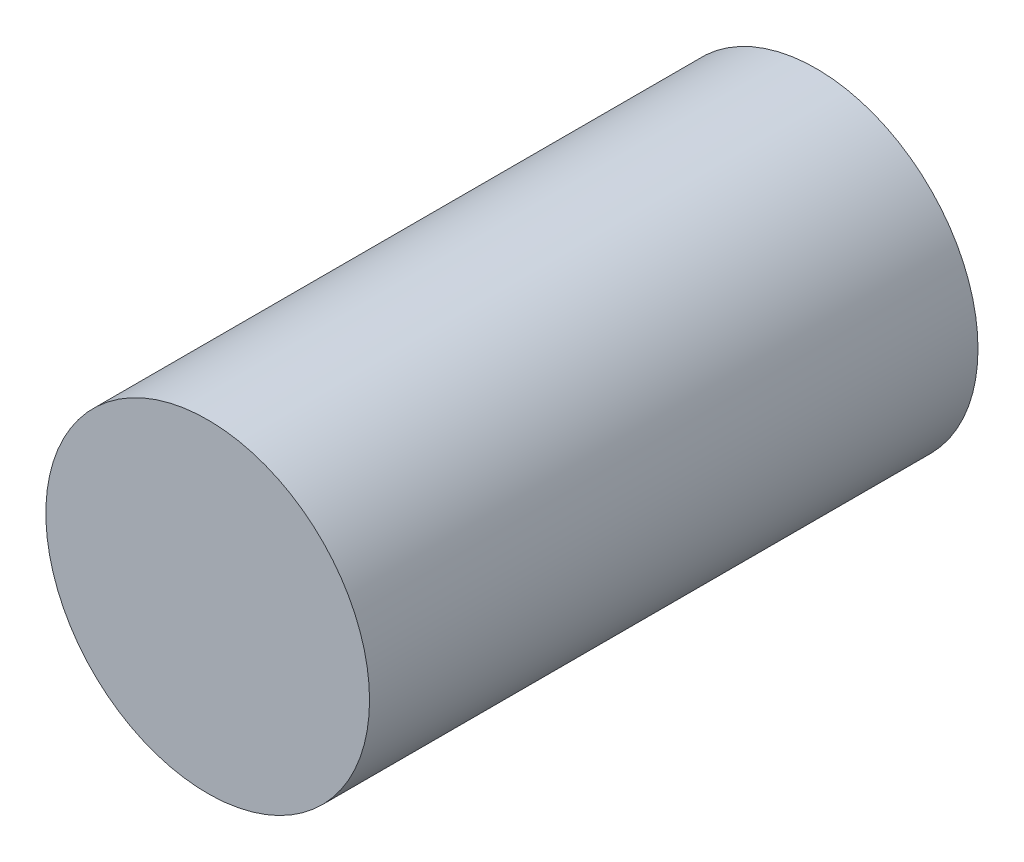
from build123d import *

# Parameters (mm, degrees)
SKETCH1_R           = 3.325
BOSS_EXTRUDE1_DEPTH = 12.5


with BuildPart() as part:
    # Sketch1 → Boss-Extrude1 (new body)
    with BuildSketch(Plane.XY):
        Circle(SKETCH1_R)
    extrude(amount=BOSS_EXTRUDE1_DEPTH)


solid = part.part
